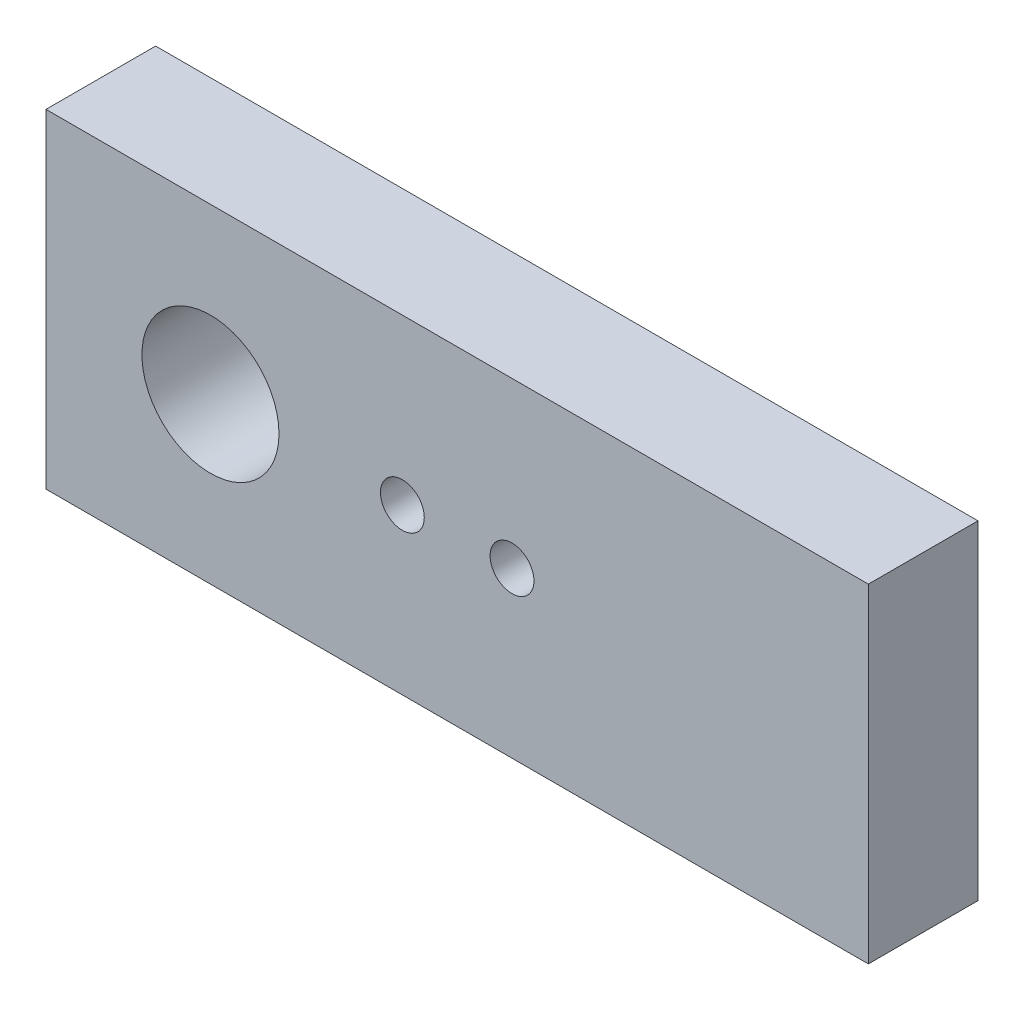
ISO-10303-21;
HEADER;
FILE_DESCRIPTION(('STEP AP214'),'2;1');
FILE_NAME('part.step','',(''),(''),'','','');
FILE_SCHEMA(('AUTOMOTIVE_DESIGN { 1 0 10303 214 1 1 1 1 }'));
ENDSEC;
DATA;
#1=APPLICATION_CONTEXT('core data for automotive mechanical design processes');
#2=APPLICATION_PROTOCOL_DEFINITION('international standard','automotive_design',2000,#1);
#3=PRODUCT_CONTEXT('',#1,'mechanical');
#4=PRODUCT('Part','Part','',(#3));
#5=PRODUCT_RELATED_PRODUCT_CATEGORY('part','',(#4));
#6=PRODUCT_DEFINITION_FORMATION('','',#4);
#7=PRODUCT_DEFINITION_CONTEXT('part definition',#1,'design');
#8=PRODUCT_DEFINITION('design','',#6,#7);
#9=PRODUCT_DEFINITION_SHAPE('','',#8);
#10=(LENGTH_UNIT() NAMED_UNIT(*) SI_UNIT(.MILLI.,.METRE.));
#11=(NAMED_UNIT(*) PLANE_ANGLE_UNIT() SI_UNIT($,.RADIAN.));
#12=(NAMED_UNIT(*) SI_UNIT($,.STERADIAN.) SOLID_ANGLE_UNIT());
#13=UNCERTAINTY_MEASURE_WITH_UNIT(LENGTH_MEASURE(1.E-05),#10,'distance_accuracy_value','');
#14=(GEOMETRIC_REPRESENTATION_CONTEXT(3) GLOBAL_UNCERTAINTY_ASSIGNED_CONTEXT((#13)) GLOBAL_UNIT_ASSIGNED_CONTEXT((#10,
#11,#12)) REPRESENTATION_CONTEXT('',''));
#15=CARTESIAN_POINT('',(0.,0.,0.));
#16=DIRECTION('',(0.,0.,1.));
#17=DIRECTION('',(1.,0.,0.));
#18=AXIS2_PLACEMENT_3D('',#15,#16,#17);
#19=CARTESIAN_POINT('',(0.,0.,-20.));
#20=DIRECTION('',(-1.,0.,0.));
#21=DIRECTION('',(0.,0.,1.));
#22=AXIS2_PLACEMENT_3D('',#19,#20,#21);
#23=PLANE('',#22);
#24=DIRECTION('',(0.,-1.,0.));
#25=VECTOR('',#24,1.);
#26=CARTESIAN_POINT('',(0.,0.,0.));
#27=LINE('',#26,#25);
#28=CARTESIAN_POINT('',(0.,60.,0.));
#29=VERTEX_POINT('',#28);
#30=CARTESIAN_POINT('',(0.,0.,0.));
#31=VERTEX_POINT('',#30);
#32=EDGE_CURVE('E106',#29,#31,#27,.T.);
#33=ORIENTED_EDGE('',*,*,#32,.F.);
#34=DIRECTION('',(0.,0.,1.));
#35=VECTOR('',#34,1.);
#36=CARTESIAN_POINT('',(0.,60.,-20.));
#37=LINE('',#36,#35);
#38=CARTESIAN_POINT('',(0.,60.,-20.));
#39=VERTEX_POINT('',#38);
#40=EDGE_CURVE('E11',#39,#29,#37,.T.);
#41=ORIENTED_EDGE('',*,*,#40,.F.);
#42=DIRECTION('',(0.,-1.,0.));
#43=VECTOR('',#42,1.);
#44=CARTESIAN_POINT('',(0.,0.,-20.));
#45=LINE('',#44,#43);
#46=CARTESIAN_POINT('',(0.,0.,-20.));
#47=VERTEX_POINT('',#46);
#48=EDGE_CURVE('E97',#39,#47,#45,.T.);
#49=ORIENTED_EDGE('',*,*,#48,.T.);
#50=DIRECTION('',(0.,0.,1.));
#51=VECTOR('',#50,1.);
#52=CARTESIAN_POINT('',(0.,0.,-20.));
#53=LINE('',#52,#51);
#54=EDGE_CURVE('E42',#47,#31,#53,.T.);
#55=ORIENTED_EDGE('',*,*,#54,.T.);
#56=EDGE_LOOP('',(#33,#41,#49,#55));
#57=FACE_BOUND('',#56,.T.);
#58=ADVANCED_FACE('F41',(#57),#23,.T.);
#59=CARTESIAN_POINT('',(0.,60.,-20.));
#60=DIRECTION('',(0.,1.,0.));
#61=DIRECTION('',(0.,0.,1.));
#62=AXIS2_PLACEMENT_3D('',#59,#60,#61);
#63=PLANE('',#62);
#64=DIRECTION('',(-1.,0.,0.));
#65=VECTOR('',#64,1.);
#66=CARTESIAN_POINT('',(0.,60.,0.));
#67=LINE('',#66,#65);
#68=CARTESIAN_POINT('',(150.,60.,0.));
#69=VERTEX_POINT('',#68);
#70=EDGE_CURVE('E101',#69,#29,#67,.T.);
#71=ORIENTED_EDGE('',*,*,#70,.F.);
#72=DIRECTION('',(0.,0.,1.));
#73=VECTOR('',#72,1.);
#74=CARTESIAN_POINT('',(150.,60.,-20.));
#75=LINE('',#74,#73);
#76=CARTESIAN_POINT('',(150.,60.,-20.));
#77=VERTEX_POINT('',#76);
#78=EDGE_CURVE('E49',#77,#69,#75,.T.);
#79=ORIENTED_EDGE('',*,*,#78,.F.);
#80=DIRECTION('',(-1.,0.,0.));
#81=VECTOR('',#80,1.);
#82=CARTESIAN_POINT('',(0.,60.,-20.));
#83=LINE('',#82,#81);
#84=EDGE_CURVE('E96',#77,#39,#83,.T.);
#85=ORIENTED_EDGE('',*,*,#84,.T.);
#86=ORIENTED_EDGE('',*,*,#40,.T.);
#87=EDGE_LOOP('',(#71,#79,#85,#86));
#88=FACE_BOUND('',#87,.T.);
#89=ADVANCED_FACE('F120',(#88),#63,.T.);
#90=CARTESIAN_POINT('',(150.,0.,-20.));
#91=DIRECTION('',(1.,0.,0.));
#92=DIRECTION('',(0.,0.,-1.));
#93=AXIS2_PLACEMENT_3D('',#90,#91,#92);
#94=PLANE('',#93);
#95=DIRECTION('',(0.,1.,0.));
#96=VECTOR('',#95,1.);
#97=CARTESIAN_POINT('',(150.,0.,0.));
#98=LINE('',#97,#96);
#99=CARTESIAN_POINT('',(150.,0.,0.));
#100=VERTEX_POINT('',#99);
#101=EDGE_CURVE('E93',#100,#69,#98,.T.);
#102=ORIENTED_EDGE('',*,*,#101,.F.);
#103=DIRECTION('',(0.,0.,1.));
#104=VECTOR('',#103,1.);
#105=CARTESIAN_POINT('',(150.,0.,-20.));
#106=LINE('',#105,#104);
#107=CARTESIAN_POINT('',(150.,0.,-20.));
#108=VERTEX_POINT('',#107);
#109=EDGE_CURVE('E88',#108,#100,#106,.T.);
#110=ORIENTED_EDGE('',*,*,#109,.F.);
#111=DIRECTION('',(0.,1.,0.));
#112=VECTOR('',#111,1.);
#113=CARTESIAN_POINT('',(150.,0.,-20.));
#114=LINE('',#113,#112);
#115=EDGE_CURVE('E90',#108,#77,#114,.T.);
#116=ORIENTED_EDGE('',*,*,#115,.T.);
#117=ORIENTED_EDGE('',*,*,#78,.T.);
#118=EDGE_LOOP('',(#102,#110,#116,#117));
#119=FACE_BOUND('',#118,.T.);
#120=ADVANCED_FACE('F86',(#119),#94,.T.);
#121=CARTESIAN_POINT('',(0.,0.,-20.));
#122=DIRECTION('',(0.,-1.,0.));
#123=DIRECTION('',(0.,0.,-1.));
#124=AXIS2_PLACEMENT_3D('',#121,#122,#123);
#125=PLANE('',#124);
#126=DIRECTION('',(1.,0.,0.));
#127=VECTOR('',#126,1.);
#128=CARTESIAN_POINT('',(0.,0.,0.));
#129=LINE('',#128,#127);
#130=EDGE_CURVE('E108',#31,#100,#129,.T.);
#131=ORIENTED_EDGE('',*,*,#130,.F.);
#132=ORIENTED_EDGE('',*,*,#54,.F.);
#133=DIRECTION('',(1.,0.,0.));
#134=VECTOR('',#133,1.);
#135=CARTESIAN_POINT('',(0.,0.,-20.));
#136=LINE('',#135,#134);
#137=EDGE_CURVE('E92',#47,#108,#136,.T.);
#138=ORIENTED_EDGE('',*,*,#137,.T.);
#139=ORIENTED_EDGE('',*,*,#109,.T.);
#140=EDGE_LOOP('',(#131,#132,#138,#139));
#141=FACE_BOUND('',#140,.T.);
#142=ADVANCED_FACE('F98',(#141),#125,.T.);
#143=CARTESIAN_POINT('',(0.,0.,-20.));
#144=DIRECTION('',(0.,0.,-1.));
#145=DIRECTION('',(-1.,0.,0.));
#146=AXIS2_PLACEMENT_3D('',#143,#144,#145);
#147=PLANE('',#146);
#148=CARTESIAN_POINT('',(65.,30.,-20.));
#149=DIRECTION('',(0.,0.,1.));
#150=DIRECTION('',(1.,0.,0.));
#151=AXIS2_PLACEMENT_3D('',#148,#149,#150);
#152=CIRCLE('',#151,4.00000000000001);
#153=CARTESIAN_POINT('',(69.,30.,-20.));
#154=VERTEX_POINT('',#153);
#155=EDGE_CURVE('E152',#154,#154,#152,.T.);
#156=ORIENTED_EDGE('',*,*,#155,.T.);
#157=EDGE_LOOP('',(#156));
#158=FACE_BOUND('',#157,.T.);
#159=CARTESIAN_POINT('',(85.,30.,-20.));
#160=DIRECTION('',(0.,0.,1.));
#161=DIRECTION('',(1.,0.,0.));
#162=AXIS2_PLACEMENT_3D('',#159,#160,#161);
#163=CIRCLE('',#162,4.00000000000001);
#164=CARTESIAN_POINT('',(89.,30.,-20.));
#165=VERTEX_POINT('',#164);
#166=EDGE_CURVE('E162',#165,#165,#163,.T.);
#167=ORIENTED_EDGE('',*,*,#166,.T.);
#168=EDGE_LOOP('',(#167));
#169=FACE_BOUND('',#168,.T.);
#170=CARTESIAN_POINT('',(30.,30.,-20.));
#171=DIRECTION('',(0.,0.,1.));
#172=DIRECTION('',(1.,0.,0.));
#173=AXIS2_PLACEMENT_3D('',#170,#171,#172);
#174=CIRCLE('',#173,12.5);
#175=CARTESIAN_POINT('',(42.5,30.,-20.));
#176=VERTEX_POINT('',#175);
#177=EDGE_CURVE('E109',#176,#176,#174,.T.);
#178=ORIENTED_EDGE('',*,*,#177,.T.);
#179=EDGE_LOOP('',(#178));
#180=FACE_BOUND('',#179,.T.);
#181=ORIENTED_EDGE('',*,*,#48,.F.);
#182=ORIENTED_EDGE('',*,*,#84,.F.);
#183=ORIENTED_EDGE('',*,*,#115,.F.);
#184=ORIENTED_EDGE('',*,*,#137,.F.);
#185=EDGE_LOOP('',(#181,#182,#183,#184));
#186=FACE_BOUND('',#185,.T.);
#187=ADVANCED_FACE('F94',(#158,#169,#180,#186),#147,.T.);
#188=CARTESIAN_POINT('',(0.,0.,0.));
#189=DIRECTION('',(0.,0.,-1.));
#190=DIRECTION('',(-1.,0.,0.));
#191=AXIS2_PLACEMENT_3D('',#188,#189,#190);
#192=PLANE('',#191);
#193=CARTESIAN_POINT('',(65.,30.,0.));
#194=DIRECTION('',(0.,0.,1.));
#195=DIRECTION('',(1.,0.,0.));
#196=AXIS2_PLACEMENT_3D('',#193,#194,#195);
#197=CIRCLE('',#196,4.00000000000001);
#198=CARTESIAN_POINT('',(69.,30.,0.));
#199=VERTEX_POINT('',#198);
#200=EDGE_CURVE('E160',#199,#199,#197,.T.);
#201=ORIENTED_EDGE('',*,*,#200,.F.);
#202=EDGE_LOOP('',(#201));
#203=FACE_BOUND('',#202,.T.);
#204=CARTESIAN_POINT('',(85.,30.,0.));
#205=DIRECTION('',(0.,0.,1.));
#206=DIRECTION('',(1.,0.,0.));
#207=AXIS2_PLACEMENT_3D('',#204,#205,#206);
#208=CIRCLE('',#207,4.00000000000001);
#209=CARTESIAN_POINT('',(89.,30.,0.));
#210=VERTEX_POINT('',#209);
#211=EDGE_CURVE('E158',#210,#210,#208,.T.);
#212=ORIENTED_EDGE('',*,*,#211,.F.);
#213=EDGE_LOOP('',(#212));
#214=FACE_BOUND('',#213,.T.);
#215=CARTESIAN_POINT('',(30.,30.,0.));
#216=DIRECTION('',(0.,0.,1.));
#217=DIRECTION('',(1.,0.,0.));
#218=AXIS2_PLACEMENT_3D('',#215,#216,#217);
#219=CIRCLE('',#218,12.5);
#220=CARTESIAN_POINT('',(42.5,30.,0.));
#221=VERTEX_POINT('',#220);
#222=EDGE_CURVE('E159',#221,#221,#219,.T.);
#223=ORIENTED_EDGE('',*,*,#222,.F.);
#224=EDGE_LOOP('',(#223));
#225=FACE_BOUND('',#224,.T.);
#226=ORIENTED_EDGE('',*,*,#32,.T.);
#227=ORIENTED_EDGE('',*,*,#130,.T.);
#228=ORIENTED_EDGE('',*,*,#101,.T.);
#229=ORIENTED_EDGE('',*,*,#70,.T.);
#230=EDGE_LOOP('',(#226,#227,#228,#229));
#231=FACE_BOUND('',#230,.T.);
#232=ADVANCED_FACE('F118',(#203,#214,#225,#231),#192,.F.);
#233=CARTESIAN_POINT('',(30.,30.,-20.));
#234=DIRECTION('',(0.,0.,1.));
#235=DIRECTION('',(1.,0.,0.));
#236=AXIS2_PLACEMENT_3D('',#233,#234,#235);
#237=CYLINDRICAL_SURFACE('',#236,12.5);
#238=ORIENTED_EDGE('',*,*,#177,.F.);
#239=EDGE_LOOP('',(#238));
#240=FACE_BOUND('',#239,.T.);
#241=ORIENTED_EDGE('',*,*,#222,.T.);
#242=EDGE_LOOP('',(#241));
#243=FACE_BOUND('',#242,.T.);
#244=ADVANCED_FACE('F137',(#240,#243),#237,.F.);
#245=CARTESIAN_POINT('',(85.,30.,-20.));
#246=DIRECTION('',(0.,0.,1.));
#247=DIRECTION('',(1.,0.,0.));
#248=AXIS2_PLACEMENT_3D('',#245,#246,#247);
#249=CYLINDRICAL_SURFACE('',#248,4.00000000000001);
#250=ORIENTED_EDGE('',*,*,#166,.F.);
#251=EDGE_LOOP('',(#250));
#252=FACE_BOUND('',#251,.T.);
#253=ORIENTED_EDGE('',*,*,#211,.T.);
#254=EDGE_LOOP('',(#253));
#255=FACE_BOUND('',#254,.T.);
#256=ADVANCED_FACE('F142',(#252,#255),#249,.F.);
#257=CARTESIAN_POINT('',(65.,30.,-20.));
#258=DIRECTION('',(0.,0.,1.));
#259=DIRECTION('',(1.,0.,0.));
#260=AXIS2_PLACEMENT_3D('',#257,#258,#259);
#261=CYLINDRICAL_SURFACE('',#260,4.00000000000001);
#262=ORIENTED_EDGE('',*,*,#155,.F.);
#263=EDGE_LOOP('',(#262));
#264=FACE_BOUND('',#263,.T.);
#265=ORIENTED_EDGE('',*,*,#200,.T.);
#266=EDGE_LOOP('',(#265));
#267=FACE_BOUND('',#266,.T.);
#268=ADVANCED_FACE('F148',(#264,#267),#261,.F.);
#269=CLOSED_SHELL('',(#58,#89,#120,#142,#187,#232,#244,#256,#268));
#270=MANIFOLD_SOLID_BREP('B2',#269);
#271=ADVANCED_BREP_SHAPE_REPRESENTATION('',(#18,#270),#14);
#272=SHAPE_DEFINITION_REPRESENTATION(#9,#271);
ENDSEC;
END-ISO-10303-21;
